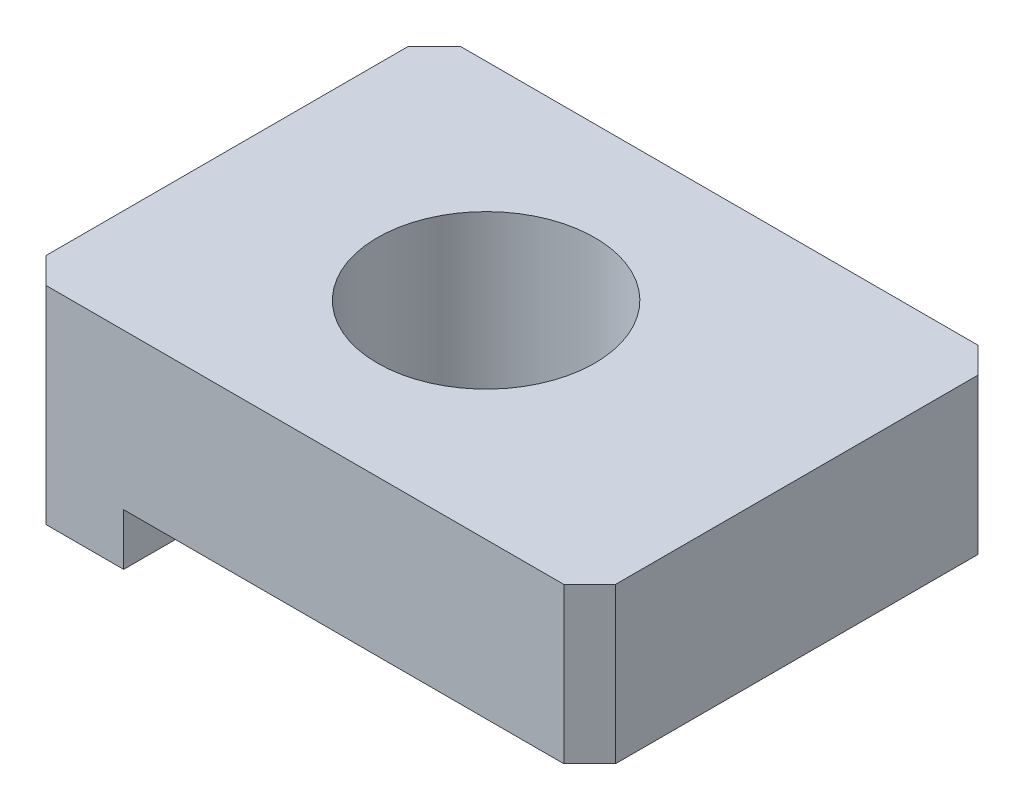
from build123d import *

# Parameters (mm, degrees)
ESQUISSE1_W                     = 11
ESQUISSE1_H                     = 8
BOSS_EXTRU_1_DEPTH              = 4
DIAM_TRE_DU_PER_AGE_4_2_4_2_1_D = 4.2
CHANFREIN1_SIZE                 = 0.5
ESQUISSE4_W                     = 10
ESQUISSE4_H                     = 1
ENL_V_MAT_EXTRU_1_DEPTH         = 10


with BuildPart() as part:
    # Esquisse1 → Boss.-Extru.1 (new body)
    with BuildSketch(Plane(origin=(0, 0, 0), x_dir=(1, 0, 0), z_dir=(0, 1, 0))):
        with Locations((5.5, 0)):
            Rectangle(ESQUISSE1_W, ESQUISSE1_H)
    extrude(amount=BOSS_EXTRU_1_DEPTH)

    # Diam_tre du per_age _4.2 _4.2_1 (through all)
    with Locations(Plane(origin=(0, 4, 0), x_dir=(1, 0, 0), z_dir=(0, 1, 0))):
        with Locations((5, 0)):
            Hole(DIAM_TRE_DU_PER_AGE_4_2_4_2_1_D / 2)

    # Chanfrein1
    chanfrein1_edges = [part.edges().sort_by_distance(p)[0] for p in [
        (0, 2, -4),
        (11, 2, -4),
        (11, 2, 4),
        (0, 2, 4),
    ]]
    chamfer(chanfrein1_edges, length=CHANFREIN1_SIZE)

    # Esquisse4 → Enl_v. mat.-Extru.1 (cut)
    with BuildSketch(Plane.XY.offset(4)):
        with Locations((7, 0.5)):
            Rectangle(ESQUISSE4_W, ESQUISSE4_H)
    extrude(amount=-ENL_V_MAT_EXTRU_1_DEPTH, mode=Mode.SUBTRACT)


solid = part.part
